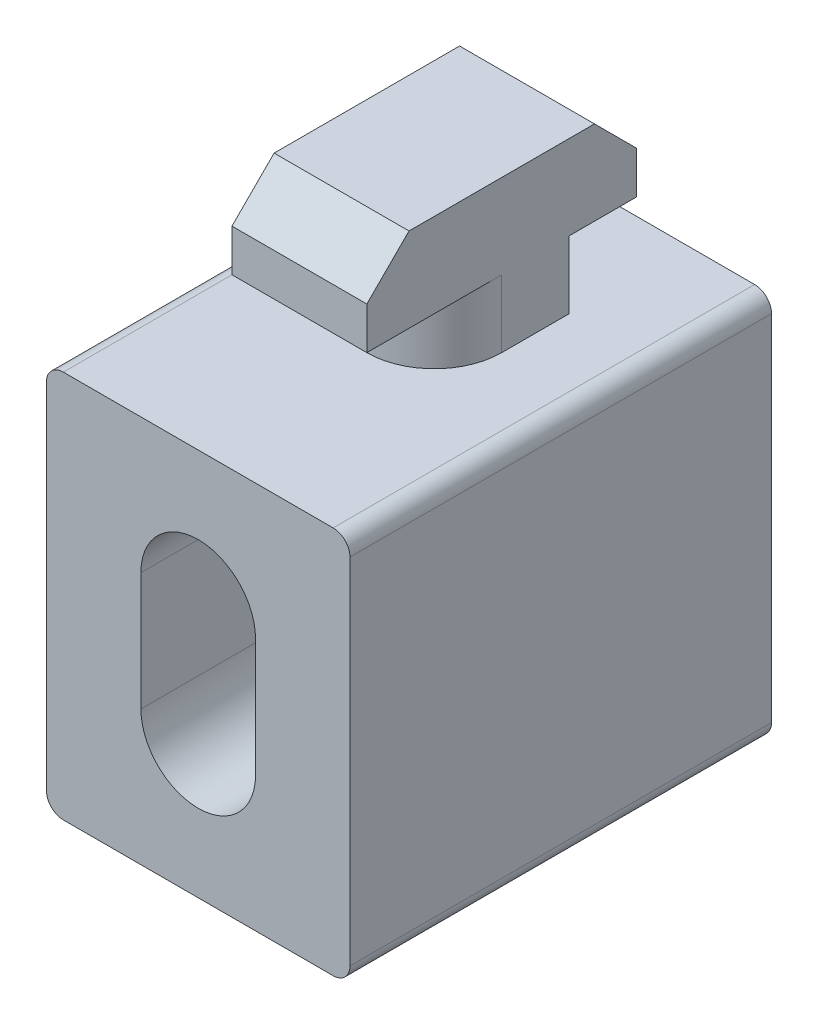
from build123d import *

# Parameters (mm, degrees)
SKETCH_1_W          = 18
SKETCH_1_H          = 23
EXTRUDE_1_DEPTH     = 12.5
CUT_EXTRUDE_1_DEPTH = 25
SKETCH_3_W          = 10
SKETCH_3_H          = 5
CUT_EXTRUDE_2_DEPTH = 18
EXTRUDE_2_DEPTH     = 4
SKETCH_5_W          = 8
SKETCH_5_H          = 16
EXTRUDE_3_DEPTH     = 5
CHAMFER_1_SIZE      = 2.5
FILLET_1_R          = 1


with BuildPart() as part:
    # Sketch 1 → Extrude 1 (new, symmetric)
    with BuildSketch(Plane.XY):
        Rectangle(SKETCH_1_W, SKETCH_1_H)
    extrude(amount=EXTRUDE_1_DEPTH, both=True)

    # Sketch 2 → Cut-Extrude 1 (cut)
    with BuildSketch(Plane.XY.offset(12.5)):
        with BuildLine():
            Line((3.4, 3.5), (3.4, -3.5))
            ThreePointArc((3.4, -3.5), (0, -6.9), (-3.4, -3.5))
            Line((-3.4, -3.5), (-3.4, 3.5))
            ThreePointArc((-3.4, 3.5), (0, 6.9), (3.4, 3.5))
        make_face()
    extrude(amount=-CUT_EXTRUDE_1_DEPTH, mode=Mode.SUBTRACT)

    # Sketch 3 → Cut-Extrude 2 (cut)
    with BuildSketch(Plane.XZ.offset(11.5)):
        with Locations((0, -1)):
            Rectangle(SKETCH_3_W, SKETCH_3_H)
    extrude(amount=-CUT_EXTRUDE_2_DEPTH, mode=Mode.SUBTRACT)

    # Sketch 4 → Extrude 2 (add)
    with BuildSketch(Plane(origin=(0, 11.5, 0), x_dir=(1, 0, 0), z_dir=(0, 1, 0))):
        with BuildLine():
            Line((0, 5.5), (4, 5.5))
            Line((4, 5.5), (4, 1.5))
            ThreePointArc((4, 1.5), (2.828427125, -1.328427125), (0, -2.5))
            Line((0, -2.5), (-4, -2.5))
            Line((-4, -2.5), (-4, 1.5))
            ThreePointArc((-4, 1.5), (-2.828427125, 4.328427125), (0, 5.5))
        make_face()
    extrude(amount=EXTRUDE_2_DEPTH)

    # Sketch 5 → Extrude 3 (add)
    with BuildSketch(Plane(origin=(0, 15.5, 0), x_dir=(1, 0, 0), z_dir=(0, 1, 0))):
        with Locations((0, 1.5)):
            Rectangle(SKETCH_5_W, SKETCH_5_H)
    extrude(amount=EXTRUDE_3_DEPTH)

    # Chamfer 1
    chamfer_1_edges = [part.edges().sort_by_distance(p)[0] for p in [
        (0, 20.5, -9.5),
        (0, 20.5, 6.5),
    ]]
    chamfer(chamfer_1_edges, length=CHAMFER_1_SIZE)

    # Fillet 1
    fillet_1_edges = [part.edges().sort_by_distance(p)[0] for p in [
        (9, -11.5, 0),
        (-9, -11.5, 0),
        (-9, 11.5, 0),
        (9, 11.5, 0),
    ]]
    fillet(fillet_1_edges, radius=FILLET_1_R)


solid = part.part
